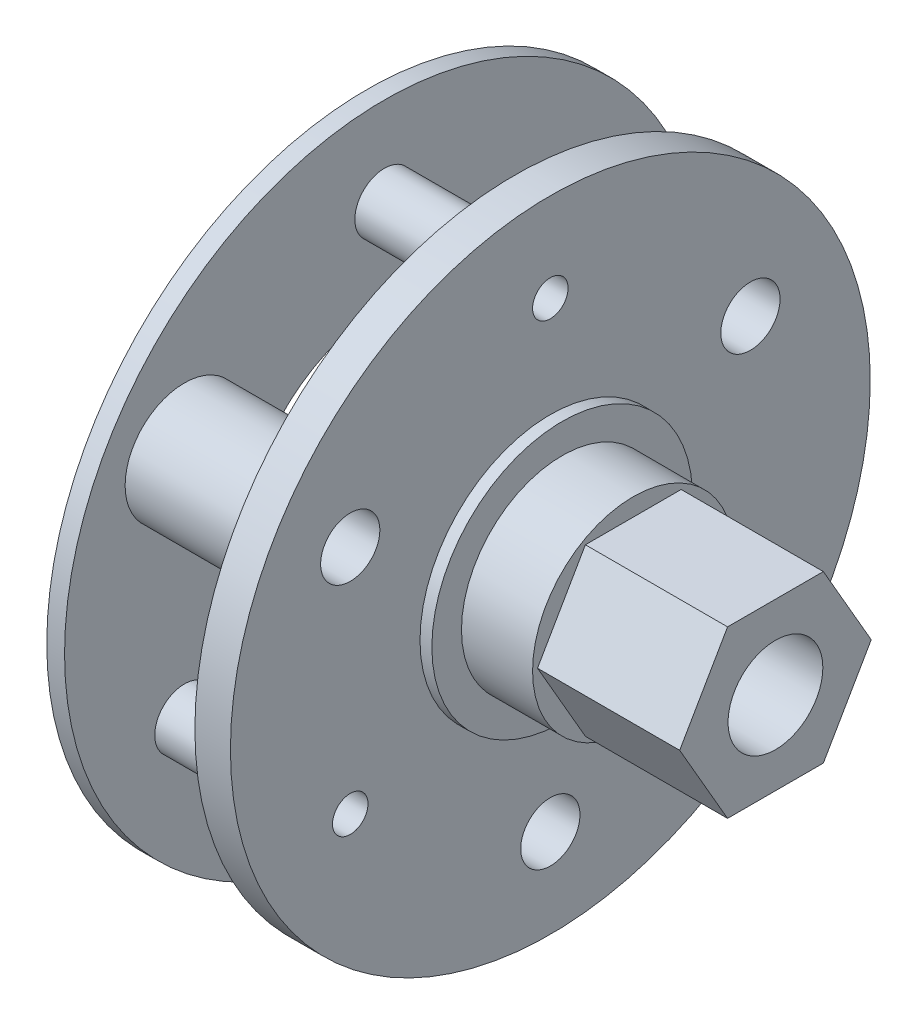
from build123d import *

# Parameters (mm, degrees)
ESQUISSE2_R                  = 2.5
ESQUISSE2_R_2                = 1.5
ESQUISSE2_R_3                = 5
BOSS_EXTRU_2_DEPTH           = 11
R_P_TITION_CIRCULAIRE1_COUNT = 3
ESQUISSE3_R                  = 27
ESQUISSE3_R_2                = 12
BOSS_EXTRU_3_DEPTH           = 1.5
ESQUISSE4_R                  = 4
ENL_V_MAT_EXTRU_1_DEPTH      = 52.461150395
ESQUISSE5_R                  = 1.5
ESQUISSE5_R_2                = 2.5
ENL_V_MAT_EXTRU_2_DEPTH      = 43.649736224
R_P_TITION_CIRCULAIRE2_COUNT = 3
ESQUISSE6_R                  = 11.180339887
ENL_V_MAT_EXTRU_4_DEPTH      = 12


with BuildPart() as part:
    # Esquisse1 → Base-R_volution (revolve)
    with BuildSketch(Plane.XY, mode=Mode.PRIVATE) as base_r_volution_sk:
        Polygon((0, 0), (0, 27), (3, 27), (3, 11), (4, 11), (4, 8.5), (22, 8.5), (22, 0), align=None)
    revolve(base_r_volution_sk.sketch.rotate(Axis((0, 0, 0), (1, 0, 0)), 90), axis=Axis((0, 0, 0), (1, 0, 0)))

    # Esquisse2 → Boss.-Extru.2 (add)
    # profile 1 of 2: a face of its own
    with BuildSketch(Plane.ZY):
        with Locations(Location((0, 19.5, 0), (0, 0, 180))):
            Circle(ESQUISSE2_R)
        with Locations(Location((0, 19.5, 0), (0, 0, 180))):
            Circle(ESQUISSE2_R_2, mode=Mode.SUBTRACT)
    # profile 2 of 2: a face of its own
    with BuildSketch(Plane.ZY):
        with Locations(Location((16.887495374, 9.75, 0), (0, 0, 180))):
            Circle(ESQUISSE2_R_3)
        with Locations(Location((16.887495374, 9.75, 0), (0, 0, 60))):
            Circle(ESQUISSE2_R, mode=Mode.SUBTRACT)
    boss_extru_2 = extrude(amount=BOSS_EXTRU_2_DEPTH)

    # R_p_tition circulaire1: Boss.-Extru.2 ×3 about axis
    r_p_tition_circulaire1_axis = Axis((0, 0, 0), (1, 0, 0))
    for i in range(1, R_P_TITION_CIRCULAIRE1_COUNT):
        add(boss_extru_2.rotate(r_p_tition_circulaire1_axis, i * 360 / R_P_TITION_CIRCULAIRE1_COUNT))

    # Esquisse3 → Boss.-Extru.3 (add)
    with BuildSketch(Plane.ZY.offset(11)):
        Circle(ESQUISSE3_R)
        Circle(ESQUISSE3_R_2, mode=Mode.SUBTRACT)
    extrude(amount=BOSS_EXTRU_3_DEPTH)

    # Esquisse4 → Enl_v. mat.-Extru.1 (cut, through all)
    with BuildSketch(Plane(origin=(22, 0, 0), x_dir=(0, 0, -1), z_dir=(1, 0, 0))):
        Circle(ESQUISSE4_R)
    extrude(amount=-ENL_V_MAT_EXTRU_1_DEPTH, mode=Mode.SUBTRACT)

    # Esquisse5 → Enl_v. mat.-Extru.2 (cut, through all)
    with BuildSketch(Plane(origin=(3, 0, 0), x_dir=(0, 0, -1), z_dir=(1, 0, 0))):
        with Locations((0, 19.5)):
            Circle(ESQUISSE5_R)
        with Locations((16.887495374, 9.75)):
            Circle(ESQUISSE5_R_2)
    enl_v_mat_extru_2 = extrude(amount=-ENL_V_MAT_EXTRU_2_DEPTH, mode=Mode.SUBTRACT)

    # R_p_tition circulaire2: Enl_v. mat.-Extru.2 ×3 about axis
    r_p_tition_circulaire2_axis = Axis((0, 0, 0), (1, 0, 0))
    for i in range(1, R_P_TITION_CIRCULAIRE2_COUNT):
        add(enl_v_mat_extru_2.rotate(r_p_tition_circulaire2_axis, i * 360 / R_P_TITION_CIRCULAIRE2_COUNT), mode=Mode.SUBTRACT)

    # Esquisse6 → Enl_v. mat.-Extru.4 (cut)
    with BuildSketch(Plane(origin=(22, 0, 0), x_dir=(0, 0, -1), z_dir=(1, 0, 0))):
        Circle(ESQUISSE6_R)
        Polygon((8.082903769, 0), (4.041451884, 7), (-4.041451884, 7), (-8.082903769, 0), (-4.041451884, -7), (4.041451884, -7), align=None, mode=Mode.SUBTRACT)
    extrude(amount=-ENL_V_MAT_EXTRU_4_DEPTH, mode=Mode.SUBTRACT)


solid = part.part
